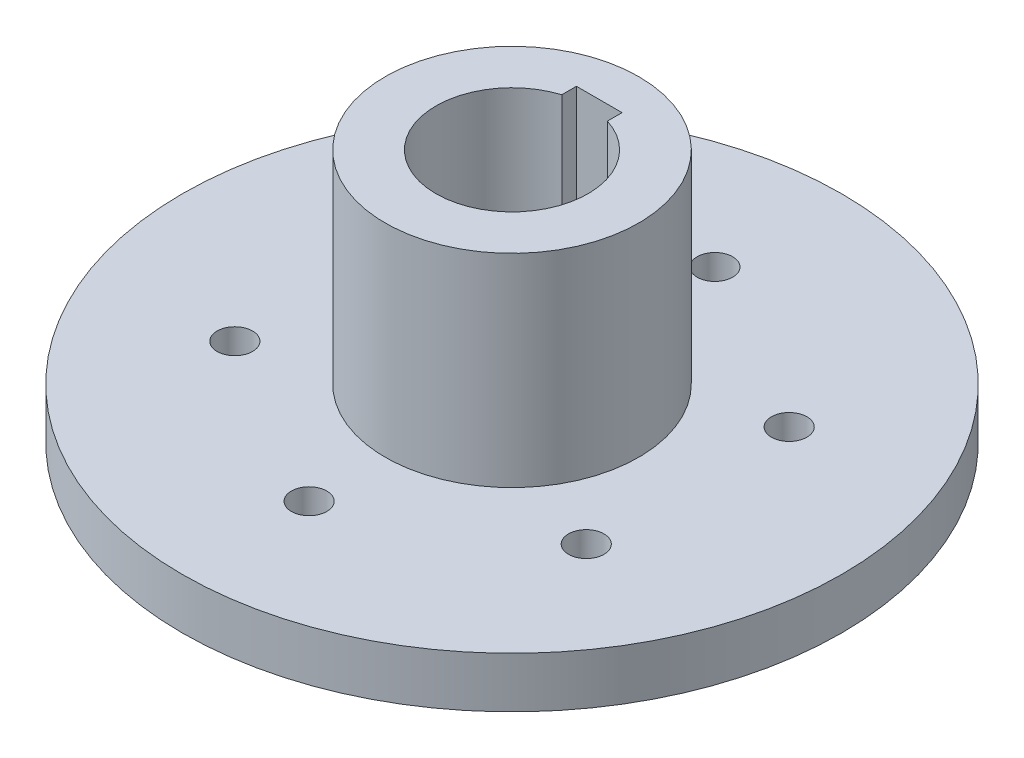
ISO-10303-21;
HEADER;
FILE_DESCRIPTION(('STEP AP214'),'2;1');
FILE_NAME('part.step','',(''),(''),'','','');
FILE_SCHEMA(('AUTOMOTIVE_DESIGN { 1 0 10303 214 1 1 1 1 }'));
ENDSEC;
DATA;
#1=APPLICATION_CONTEXT('core data for automotive mechanical design processes');
#2=APPLICATION_PROTOCOL_DEFINITION('international standard','automotive_design',2000,#1);
#3=PRODUCT_CONTEXT('',#1,'mechanical');
#4=PRODUCT('Part','Part','',(#3));
#5=PRODUCT_RELATED_PRODUCT_CATEGORY('part','',(#4));
#6=PRODUCT_DEFINITION_FORMATION('','',#4);
#7=PRODUCT_DEFINITION_CONTEXT('part definition',#1,'design');
#8=PRODUCT_DEFINITION('design','',#6,#7);
#9=PRODUCT_DEFINITION_SHAPE('','',#8);
#10=(LENGTH_UNIT() NAMED_UNIT(*) SI_UNIT(.MILLI.,.METRE.));
#11=(NAMED_UNIT(*) PLANE_ANGLE_UNIT() SI_UNIT($,.RADIAN.));
#12=(NAMED_UNIT(*) SI_UNIT($,.STERADIAN.) SOLID_ANGLE_UNIT());
#13=UNCERTAINTY_MEASURE_WITH_UNIT(LENGTH_MEASURE(1.E-05),#10,'distance_accuracy_value','');
#14=(GEOMETRIC_REPRESENTATION_CONTEXT(3) GLOBAL_UNCERTAINTY_ASSIGNED_CONTEXT((#13)) GLOBAL_UNIT_ASSIGNED_CONTEXT((#10,
#11,#12)) REPRESENTATION_CONTEXT('',''));
#15=CARTESIAN_POINT('',(0.,0.,0.));
#16=DIRECTION('',(0.,0.,1.));
#17=DIRECTION('',(1.,0.,0.));
#18=AXIS2_PLACEMENT_3D('',#15,#16,#17);
#19=CARTESIAN_POINT('',(100.,0.,0.));
#20=DIRECTION('',(0.,-1.,0.));
#21=DIRECTION('',(0.,0.,-1.));
#22=AXIS2_PLACEMENT_3D('',#19,#20,#21);
#23=PLANE('',#22);
#24=CARTESIAN_POINT('',(-99.2820323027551,0.,-39.9999999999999));
#25=DIRECTION('',(0.,1.,0.));
#26=DIRECTION('',(0.,0.,1.));
#27=AXIS2_PLACEMENT_3D('',#24,#25,#26);
#28=CIRCLE('',#27,6.99999999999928);
#29=CARTESIAN_POINT('',(-99.2820323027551,0.,-33.0000000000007));
#30=VERTEX_POINT('',#29);
#31=EDGE_CURVE('E97',#30,#30,#28,.T.);
#32=ORIENTED_EDGE('',*,*,#31,.T.);
#33=EDGE_LOOP('',(#32));
#34=FACE_BOUND('',#33,.T.);
#35=CARTESIAN_POINT('',(-99.2820323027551,0.,40.));
#36=DIRECTION('',(0.,1.,0.));
#37=DIRECTION('',(0.,0.,1.));
#38=AXIS2_PLACEMENT_3D('',#35,#36,#37);
#39=CIRCLE('',#38,6.99999999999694);
#40=CARTESIAN_POINT('',(-99.2820323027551,0.,46.999999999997));
#41=VERTEX_POINT('',#40);
#42=EDGE_CURVE('E184',#41,#41,#39,.T.);
#43=ORIENTED_EDGE('',*,*,#42,.T.);
#44=EDGE_LOOP('',(#43));
#45=FACE_BOUND('',#44,.T.);
#46=CARTESIAN_POINT('',(-30.,0.,80.));
#47=DIRECTION('',(0.,1.,0.));
#48=DIRECTION('',(0.,0.,1.));
#49=AXIS2_PLACEMENT_3D('',#46,#47,#48);
#50=CIRCLE('',#49,6.99999999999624);
#51=CARTESIAN_POINT('',(-30.,0.,86.9999999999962));
#52=VERTEX_POINT('',#51);
#53=EDGE_CURVE('E188',#52,#52,#50,.T.);
#54=ORIENTED_EDGE('',*,*,#53,.T.);
#55=EDGE_LOOP('',(#54));
#56=FACE_BOUND('',#55,.T.);
#57=CARTESIAN_POINT('',(39.2820323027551,0.,40.));
#58=DIRECTION('',(0.,1.,0.));
#59=DIRECTION('',(0.,0.,1.));
#60=AXIS2_PLACEMENT_3D('',#57,#58,#59);
#61=CIRCLE('',#60,6.99999999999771);
#62=CARTESIAN_POINT('',(39.2820323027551,0.,46.9999999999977));
#63=VERTEX_POINT('',#62);
#64=EDGE_CURVE('E192',#63,#63,#61,.T.);
#65=ORIENTED_EDGE('',*,*,#64,.T.);
#66=EDGE_LOOP('',(#65));
#67=FACE_BOUND('',#66,.T.);
#68=CARTESIAN_POINT('',(39.2820323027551,0.,-40.));
#69=DIRECTION('',(0.,1.,0.));
#70=DIRECTION('',(0.,0.,1.));
#71=AXIS2_PLACEMENT_3D('',#68,#69,#70);
#72=CIRCLE('',#71,6.99999999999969);
#73=CARTESIAN_POINT('',(39.2820323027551,0.,-33.0000000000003));
#74=VERTEX_POINT('',#73);
#75=EDGE_CURVE('E196',#74,#74,#72,.T.);
#76=ORIENTED_EDGE('',*,*,#75,.T.);
#77=EDGE_LOOP('',(#76));
#78=FACE_BOUND('',#77,.T.);
#79=CARTESIAN_POINT('',(-30.,0.,-80.));
#80=DIRECTION('',(0.,1.,0.));
#81=DIRECTION('',(0.,0.,1.));
#82=AXIS2_PLACEMENT_3D('',#79,#80,#81);
#83=CIRCLE('',#82,7.);
#84=CARTESIAN_POINT('',(-30.,0.,-73.));
#85=VERTEX_POINT('',#84);
#86=EDGE_CURVE('E101',#85,#85,#83,.T.);
#87=ORIENTED_EDGE('',*,*,#86,.T.);
#88=EDGE_LOOP('',(#87));
#89=FACE_BOUND('',#88,.T.);
#90=DIRECTION('',(0.,0.,-1.));
#91=VECTOR('',#90,1.);
#92=CARTESIAN_POINT('',(-21.,0.,-34.4));
#93=LINE('',#92,#91);
#94=CARTESIAN_POINT('',(-21.,0.,-28.6181760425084));
#95=VERTEX_POINT('',#94);
#96=CARTESIAN_POINT('',(-21.,0.,-34.4));
#97=VERTEX_POINT('',#96);
#98=EDGE_CURVE('E59',#95,#97,#93,.T.);
#99=ORIENTED_EDGE('',*,*,#98,.T.);
#100=DIRECTION('',(-1.,0.,0.));
#101=VECTOR('',#100,1.);
#102=CARTESIAN_POINT('',(-39.,0.,-34.4));
#103=LINE('',#102,#101);
#104=CARTESIAN_POINT('',(-39.,0.,-34.4));
#105=VERTEX_POINT('',#104);
#106=EDGE_CURVE('E83',#97,#105,#103,.T.);
#107=ORIENTED_EDGE('',*,*,#106,.T.);
#108=DIRECTION('',(0.,0.,1.));
#109=VECTOR('',#108,1.);
#110=CARTESIAN_POINT('',(-39.,0.,-34.4));
#111=LINE('',#110,#109);
#112=CARTESIAN_POINT('',(-39.,0.,-28.6181760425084));
#113=VERTEX_POINT('',#112);
#114=EDGE_CURVE('E80',#105,#113,#111,.T.);
#115=ORIENTED_EDGE('',*,*,#114,.T.);
#116=CARTESIAN_POINT('',(-30.,0.,0.));
#117=DIRECTION('',(0.,-1.,0.));
#118=DIRECTION('',(0.,0.,-1.));
#119=AXIS2_PLACEMENT_3D('',#116,#117,#118);
#120=CIRCLE('',#119,30.);
#121=EDGE_CURVE('E46',#95,#113,#120,.T.);
#122=ORIENTED_EDGE('',*,*,#121,.F.);
#123=EDGE_LOOP('',(#99,#107,#115,#122));
#124=FACE_BOUND('',#123,.T.);
#125=CARTESIAN_POINT('',(-30.,0.,0.));
#126=DIRECTION('',(0.,-1.,0.));
#127=DIRECTION('',(0.,0.,-1.));
#128=AXIS2_PLACEMENT_3D('',#125,#126,#127);
#129=CIRCLE('',#128,130.);
#130=CARTESIAN_POINT('',(-30.,0.,-130.));
#131=VERTEX_POINT('',#130);
#132=EDGE_CURVE('E110',#131,#131,#129,.T.);
#133=ORIENTED_EDGE('',*,*,#132,.T.);
#134=EDGE_LOOP('',(#133));
#135=FACE_BOUND('',#134,.T.);
#136=ADVANCED_FACE('F39',(#34,#45,#56,#67,#78,#89,#124,#135),#23,.T.);
#137=CARTESIAN_POINT('',(-30.,-0.140675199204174,0.));
#138=DIRECTION('',(0.,-1.,0.));
#139=DIRECTION('',(0.,0.,-1.));
#140=AXIS2_PLACEMENT_3D('',#137,#138,#139);
#141=CYLINDRICAL_SURFACE('',#140,30.);
#142=DIRECTION('',(0.,-1.,0.));
#143=VECTOR('',#142,1.);
#144=CARTESIAN_POINT('',(-21.,-0.140675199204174,-28.6181760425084));
#145=LINE('',#144,#143);
#146=CARTESIAN_POINT('',(-21.,100.,-28.6181760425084));
#147=VERTEX_POINT('',#146);
#148=EDGE_CURVE('E107',#95,#147,#145,.F.);
#149=ORIENTED_EDGE('',*,*,#148,.F.);
#150=ORIENTED_EDGE('',*,*,#121,.T.);
#151=DIRECTION('',(0.,-1.,0.));
#152=VECTOR('',#151,1.);
#153=CARTESIAN_POINT('',(-39.,-0.140675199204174,-28.6181760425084));
#154=LINE('',#153,#152);
#155=CARTESIAN_POINT('',(-39.,100.,-28.6181760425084));
#156=VERTEX_POINT('',#155);
#157=EDGE_CURVE('E105',#156,#113,#154,.T.);
#158=ORIENTED_EDGE('',*,*,#157,.F.);
#159=CARTESIAN_POINT('',(-30.,100.,0.));
#160=DIRECTION('',(0.,-1.,0.));
#161=DIRECTION('',(0.,0.,-1.));
#162=AXIS2_PLACEMENT_3D('',#159,#160,#161);
#163=CIRCLE('',#162,30.);
#164=EDGE_CURVE('E122',#147,#156,#163,.T.);
#165=ORIENTED_EDGE('',*,*,#164,.F.);
#166=EDGE_LOOP('',(#149,#150,#158,#165));
#167=FACE_BOUND('',#166,.T.);
#168=ADVANCED_FACE('F171',(#167),#141,.F.);
#169=CARTESIAN_POINT('',(0.,100.,0.));
#170=DIRECTION('',(0.,1.,0.));
#171=DIRECTION('',(0.,0.,1.));
#172=AXIS2_PLACEMENT_3D('',#169,#170,#171);
#173=PLANE('',#172);
#174=DIRECTION('',(0.,0.,-1.));
#175=VECTOR('',#174,1.);
#176=CARTESIAN_POINT('',(-21.,100.,0.));
#177=LINE('',#176,#175);
#178=CARTESIAN_POINT('',(-21.,100.,-34.4));
#179=VERTEX_POINT('',#178);
#180=EDGE_CURVE('E11',#147,#179,#177,.T.);
#181=ORIENTED_EDGE('',*,*,#180,.F.);
#182=ORIENTED_EDGE('',*,*,#164,.T.);
#183=DIRECTION('',(0.,0.,1.));
#184=VECTOR('',#183,1.);
#185=CARTESIAN_POINT('',(-39.,100.,-34.4));
#186=LINE('',#185,#184);
#187=CARTESIAN_POINT('',(-39.,100.,-34.4));
#188=VERTEX_POINT('',#187);
#189=EDGE_CURVE('E92',#188,#156,#186,.T.);
#190=ORIENTED_EDGE('',*,*,#189,.F.);
#191=DIRECTION('',(-1.,0.,0.));
#192=VECTOR('',#191,1.);
#193=CARTESIAN_POINT('',(-39.,100.,-34.4));
#194=LINE('',#193,#192);
#195=EDGE_CURVE('E94',#179,#188,#194,.T.);
#196=ORIENTED_EDGE('',*,*,#195,.F.);
#197=EDGE_LOOP('',(#181,#182,#190,#196));
#198=FACE_BOUND('',#197,.T.);
#199=CARTESIAN_POINT('',(-30.,100.,0.));
#200=DIRECTION('',(0.,-1.,0.));
#201=DIRECTION('',(0.,0.,-1.));
#202=AXIS2_PLACEMENT_3D('',#199,#200,#201);
#203=CIRCLE('',#202,50.);
#204=CARTESIAN_POINT('',(-30.,100.,-50.));
#205=VERTEX_POINT('',#204);
#206=EDGE_CURVE('E119',#205,#205,#203,.T.);
#207=ORIENTED_EDGE('',*,*,#206,.F.);
#208=EDGE_LOOP('',(#207));
#209=FACE_BOUND('',#208,.T.);
#210=ADVANCED_FACE('F176',(#198,#209),#173,.T.);
#211=CARTESIAN_POINT('',(-30.,-0.140675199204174,0.));
#212=DIRECTION('',(0.,-1.,0.));
#213=DIRECTION('',(0.,0.,-1.));
#214=AXIS2_PLACEMENT_3D('',#211,#212,#213);
#215=CYLINDRICAL_SURFACE('',#214,50.);
#216=ORIENTED_EDGE('',*,*,#206,.T.);
#217=EDGE_LOOP('',(#216));
#218=FACE_BOUND('',#217,.T.);
#219=CARTESIAN_POINT('',(-30.,20.,0.));
#220=DIRECTION('',(0.,-1.,0.));
#221=DIRECTION('',(0.,0.,-1.));
#222=AXIS2_PLACEMENT_3D('',#219,#220,#221);
#223=CIRCLE('',#222,50.);
#224=CARTESIAN_POINT('',(-30.,20.,-50.));
#225=VERTEX_POINT('',#224);
#226=EDGE_CURVE('E116',#225,#225,#223,.T.);
#227=ORIENTED_EDGE('',*,*,#226,.F.);
#228=EDGE_LOOP('',(#227));
#229=FACE_BOUND('',#228,.T.);
#230=ADVANCED_FACE('F149',(#218,#229),#215,.T.);
#231=CARTESIAN_POINT('',(20.,20.,0.));
#232=DIRECTION('',(0.,1.,0.));
#233=DIRECTION('',(0.,0.,1.));
#234=AXIS2_PLACEMENT_3D('',#231,#232,#233);
#235=PLANE('',#234);
#236=CARTESIAN_POINT('',(-99.2820323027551,20.,-39.9999999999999));
#237=DIRECTION('',(0.,1.,0.));
#238=DIRECTION('',(0.,0.,1.));
#239=AXIS2_PLACEMENT_3D('',#236,#237,#238);
#240=CIRCLE('',#239,6.99999999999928);
#241=CARTESIAN_POINT('',(-99.2820323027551,20.,-33.0000000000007));
#242=VERTEX_POINT('',#241);
#243=EDGE_CURVE('E108',#242,#242,#240,.T.);
#244=ORIENTED_EDGE('',*,*,#243,.F.);
#245=EDGE_LOOP('',(#244));
#246=FACE_BOUND('',#245,.T.);
#247=CARTESIAN_POINT('',(-99.2820323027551,20.,40.));
#248=DIRECTION('',(0.,1.,0.));
#249=DIRECTION('',(0.,0.,1.));
#250=AXIS2_PLACEMENT_3D('',#247,#248,#249);
#251=CIRCLE('',#250,6.99999999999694);
#252=CARTESIAN_POINT('',(-99.2820323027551,20.,46.999999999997));
#253=VERTEX_POINT('',#252);
#254=EDGE_CURVE('E137',#253,#253,#251,.T.);
#255=ORIENTED_EDGE('',*,*,#254,.F.);
#256=EDGE_LOOP('',(#255));
#257=FACE_BOUND('',#256,.T.);
#258=CARTESIAN_POINT('',(-30.,20.,80.));
#259=DIRECTION('',(0.,1.,0.));
#260=DIRECTION('',(0.,0.,1.));
#261=AXIS2_PLACEMENT_3D('',#258,#259,#260);
#262=CIRCLE('',#261,6.99999999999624);
#263=CARTESIAN_POINT('',(-30.,20.,86.9999999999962));
#264=VERTEX_POINT('',#263);
#265=EDGE_CURVE('E134',#264,#264,#262,.T.);
#266=ORIENTED_EDGE('',*,*,#265,.F.);
#267=EDGE_LOOP('',(#266));
#268=FACE_BOUND('',#267,.T.);
#269=CARTESIAN_POINT('',(39.2820323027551,20.,40.));
#270=DIRECTION('',(0.,1.,0.));
#271=DIRECTION('',(0.,0.,1.));
#272=AXIS2_PLACEMENT_3D('',#269,#270,#271);
#273=CIRCLE('',#272,6.99999999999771);
#274=CARTESIAN_POINT('',(39.2820323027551,20.,46.9999999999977));
#275=VERTEX_POINT('',#274);
#276=EDGE_CURVE('E131',#275,#275,#273,.T.);
#277=ORIENTED_EDGE('',*,*,#276,.F.);
#278=EDGE_LOOP('',(#277));
#279=FACE_BOUND('',#278,.T.);
#280=CARTESIAN_POINT('',(39.2820323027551,20.,-40.));
#281=DIRECTION('',(0.,1.,0.));
#282=DIRECTION('',(0.,0.,1.));
#283=AXIS2_PLACEMENT_3D('',#280,#281,#282);
#284=CIRCLE('',#283,6.99999999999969);
#285=CARTESIAN_POINT('',(39.2820323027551,20.,-33.0000000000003));
#286=VERTEX_POINT('',#285);
#287=EDGE_CURVE('E128',#286,#286,#284,.T.);
#288=ORIENTED_EDGE('',*,*,#287,.F.);
#289=EDGE_LOOP('',(#288));
#290=FACE_BOUND('',#289,.T.);
#291=CARTESIAN_POINT('',(-30.,20.,-80.));
#292=DIRECTION('',(0.,1.,0.));
#293=DIRECTION('',(0.,0.,1.));
#294=AXIS2_PLACEMENT_3D('',#291,#292,#293);
#295=CIRCLE('',#294,7.);
#296=CARTESIAN_POINT('',(-30.,20.,-73.));
#297=VERTEX_POINT('',#296);
#298=EDGE_CURVE('E103',#297,#297,#295,.T.);
#299=ORIENTED_EDGE('',*,*,#298,.F.);
#300=EDGE_LOOP('',(#299));
#301=FACE_BOUND('',#300,.T.);
#302=ORIENTED_EDGE('',*,*,#226,.T.);
#303=EDGE_LOOP('',(#302));
#304=FACE_BOUND('',#303,.T.);
#305=CARTESIAN_POINT('',(-30.,20.,0.));
#306=DIRECTION('',(0.,-1.,0.));
#307=DIRECTION('',(0.,0.,-1.));
#308=AXIS2_PLACEMENT_3D('',#305,#306,#307);
#309=CIRCLE('',#308,130.);
#310=CARTESIAN_POINT('',(-30.,20.,-130.));
#311=VERTEX_POINT('',#310);
#312=EDGE_CURVE('E113',#311,#311,#309,.T.);
#313=ORIENTED_EDGE('',*,*,#312,.F.);
#314=EDGE_LOOP('',(#313));
#315=FACE_BOUND('',#314,.T.);
#316=ADVANCED_FACE('F145',(#246,#257,#268,#279,#290,#301,#304,#315),#235,.T.);
#317=CARTESIAN_POINT('',(-30.,-0.140675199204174,0.));
#318=DIRECTION('',(0.,-1.,0.));
#319=DIRECTION('',(0.,0.,-1.));
#320=AXIS2_PLACEMENT_3D('',#317,#318,#319);
#321=CYLINDRICAL_SURFACE('',#320,130.);
#322=ORIENTED_EDGE('',*,*,#312,.T.);
#323=EDGE_LOOP('',(#322));
#324=FACE_BOUND('',#323,.T.);
#325=ORIENTED_EDGE('',*,*,#132,.F.);
#326=EDGE_LOOP('',(#325));
#327=FACE_BOUND('',#326,.T.);
#328=ADVANCED_FACE('F148',(#324,#327),#321,.T.);
#329=CARTESIAN_POINT('',(-30.,0.,-80.));
#330=DIRECTION('',(0.,1.,0.));
#331=DIRECTION('',(0.,0.,1.));
#332=AXIS2_PLACEMENT_3D('',#329,#330,#331);
#333=CYLINDRICAL_SURFACE('',#332,7.);
#334=ORIENTED_EDGE('',*,*,#298,.T.);
#335=EDGE_LOOP('',(#334));
#336=FACE_BOUND('',#335,.T.);
#337=ORIENTED_EDGE('',*,*,#86,.F.);
#338=EDGE_LOOP('',(#337));
#339=FACE_BOUND('',#338,.T.);
#340=ADVANCED_FACE('F167',(#336,#339),#333,.F.);
#341=CARTESIAN_POINT('',(39.2820323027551,0.,-40.));
#342=DIRECTION('',(0.,1.,0.));
#343=DIRECTION('',(0.,0.,1.));
#344=AXIS2_PLACEMENT_3D('',#341,#342,#343);
#345=CYLINDRICAL_SURFACE('',#344,6.99999999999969);
#346=ORIENTED_EDGE('',*,*,#287,.T.);
#347=EDGE_LOOP('',(#346));
#348=FACE_BOUND('',#347,.T.);
#349=ORIENTED_EDGE('',*,*,#75,.F.);
#350=EDGE_LOOP('',(#349));
#351=FACE_BOUND('',#350,.T.);
#352=ADVANCED_FACE('F205',(#348,#351),#345,.F.);
#353=CARTESIAN_POINT('',(39.2820323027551,0.,40.));
#354=DIRECTION('',(0.,1.,0.));
#355=DIRECTION('',(0.,0.,1.));
#356=AXIS2_PLACEMENT_3D('',#353,#354,#355);
#357=CYLINDRICAL_SURFACE('',#356,6.99999999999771);
#358=ORIENTED_EDGE('',*,*,#276,.T.);
#359=EDGE_LOOP('',(#358));
#360=FACE_BOUND('',#359,.T.);
#361=ORIENTED_EDGE('',*,*,#64,.F.);
#362=EDGE_LOOP('',(#361));
#363=FACE_BOUND('',#362,.T.);
#364=ADVANCED_FACE('F211',(#360,#363),#357,.F.);
#365=CARTESIAN_POINT('',(-30.,0.,80.));
#366=DIRECTION('',(0.,1.,0.));
#367=DIRECTION('',(0.,0.,1.));
#368=AXIS2_PLACEMENT_3D('',#365,#366,#367);
#369=CYLINDRICAL_SURFACE('',#368,6.99999999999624);
#370=ORIENTED_EDGE('',*,*,#265,.T.);
#371=EDGE_LOOP('',(#370));
#372=FACE_BOUND('',#371,.T.);
#373=ORIENTED_EDGE('',*,*,#53,.F.);
#374=EDGE_LOOP('',(#373));
#375=FACE_BOUND('',#374,.T.);
#376=ADVANCED_FACE('F217',(#372,#375),#369,.F.);
#377=CARTESIAN_POINT('',(-99.2820323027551,0.,40.));
#378=DIRECTION('',(0.,1.,0.));
#379=DIRECTION('',(0.,0.,1.));
#380=AXIS2_PLACEMENT_3D('',#377,#378,#379);
#381=CYLINDRICAL_SURFACE('',#380,6.99999999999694);
#382=ORIENTED_EDGE('',*,*,#254,.T.);
#383=EDGE_LOOP('',(#382));
#384=FACE_BOUND('',#383,.T.);
#385=ORIENTED_EDGE('',*,*,#42,.F.);
#386=EDGE_LOOP('',(#385));
#387=FACE_BOUND('',#386,.T.);
#388=ADVANCED_FACE('F221',(#384,#387),#381,.F.);
#389=CARTESIAN_POINT('',(-99.2820323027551,0.,-39.9999999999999));
#390=DIRECTION('',(0.,1.,0.));
#391=DIRECTION('',(0.,0.,1.));
#392=AXIS2_PLACEMENT_3D('',#389,#390,#391);
#393=CYLINDRICAL_SURFACE('',#392,6.99999999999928);
#394=ORIENTED_EDGE('',*,*,#243,.T.);
#395=EDGE_LOOP('',(#394));
#396=FACE_BOUND('',#395,.T.);
#397=ORIENTED_EDGE('',*,*,#31,.F.);
#398=EDGE_LOOP('',(#397));
#399=FACE_BOUND('',#398,.T.);
#400=ADVANCED_FACE('F142',(#396,#399),#393,.F.);
#401=CARTESIAN_POINT('',(-21.,0.,-34.4));
#402=DIRECTION('',(1.,0.,0.));
#403=DIRECTION('',(0.,0.,-1.));
#404=AXIS2_PLACEMENT_3D('',#401,#402,#403);
#405=PLANE('',#404);
#406=ORIENTED_EDGE('',*,*,#148,.T.);
#407=ORIENTED_EDGE('',*,*,#180,.T.);
#408=DIRECTION('',(0.,1.,0.));
#409=VECTOR('',#408,1.);
#410=CARTESIAN_POINT('',(-21.,0.,-34.4));
#411=LINE('',#410,#409);
#412=EDGE_CURVE('E53',#97,#179,#411,.T.);
#413=ORIENTED_EDGE('',*,*,#412,.F.);
#414=ORIENTED_EDGE('',*,*,#98,.F.);
#415=EDGE_LOOP('',(#406,#407,#413,#414));
#416=FACE_BOUND('',#415,.T.);
#417=ADVANCED_FACE('F76',(#416),#405,.F.);
#418=CARTESIAN_POINT('',(-39.,0.,-34.4));
#419=DIRECTION('',(-1.,0.,0.));
#420=DIRECTION('',(0.,0.,1.));
#421=AXIS2_PLACEMENT_3D('',#418,#419,#420);
#422=PLANE('',#421);
#423=ORIENTED_EDGE('',*,*,#157,.T.);
#424=ORIENTED_EDGE('',*,*,#114,.F.);
#425=DIRECTION('',(0.,1.,0.));
#426=VECTOR('',#425,1.);
#427=CARTESIAN_POINT('',(-39.,0.,-34.4));
#428=LINE('',#427,#426);
#429=EDGE_CURVE('E79',#105,#188,#428,.T.);
#430=ORIENTED_EDGE('',*,*,#429,.T.);
#431=ORIENTED_EDGE('',*,*,#189,.T.);
#432=EDGE_LOOP('',(#423,#424,#430,#431));
#433=FACE_BOUND('',#432,.T.);
#434=ADVANCED_FACE('F228',(#433),#422,.F.);
#435=CARTESIAN_POINT('',(-39.,0.,-34.4));
#436=DIRECTION('',(0.,0.,-1.));
#437=DIRECTION('',(-1.,0.,0.));
#438=AXIS2_PLACEMENT_3D('',#435,#436,#437);
#439=PLANE('',#438);
#440=ORIENTED_EDGE('',*,*,#195,.T.);
#441=ORIENTED_EDGE('',*,*,#429,.F.);
#442=ORIENTED_EDGE('',*,*,#106,.F.);
#443=ORIENTED_EDGE('',*,*,#412,.T.);
#444=EDGE_LOOP('',(#440,#441,#442,#443));
#445=FACE_BOUND('',#444,.T.);
#446=ADVANCED_FACE('F84',(#445),#439,.F.);
#447=CLOSED_SHELL('',(#136,#168,#210,#230,#316,#328,#340,#352,#364,#376,#388,#400,#417,#434,#446));
#448=MANIFOLD_SOLID_BREP('B2',#447);
#449=ADVANCED_BREP_SHAPE_REPRESENTATION('',(#18,#448),#14);
#450=SHAPE_DEFINITION_REPRESENTATION(#9,#449);
ENDSEC;
END-ISO-10303-21;
